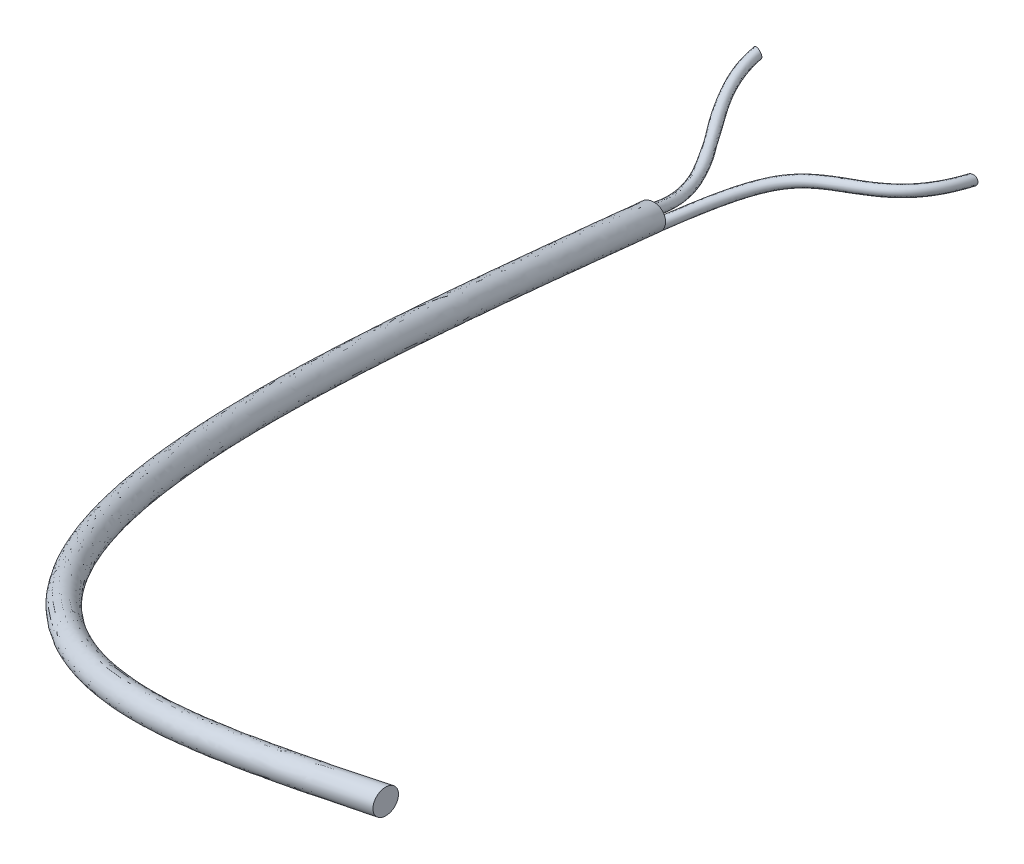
ISO-10303-21;
HEADER;
FILE_DESCRIPTION(('STEP AP214'),'2;1');
FILE_NAME('part.step','',(''),(''),'','','');
FILE_SCHEMA(('AUTOMOTIVE_DESIGN { 1 0 10303 214 1 1 1 1 }'));
ENDSEC;
DATA;
#1=APPLICATION_CONTEXT('core data for automotive mechanical design processes');
#2=APPLICATION_PROTOCOL_DEFINITION('international standard','automotive_design',2000,#1);
#3=PRODUCT_CONTEXT('',#1,'mechanical');
#4=PRODUCT('Part','Part','',(#3));
#5=PRODUCT_RELATED_PRODUCT_CATEGORY('part','',(#4));
#6=PRODUCT_DEFINITION_FORMATION('','',#4);
#7=PRODUCT_DEFINITION_CONTEXT('part definition',#1,'design');
#8=PRODUCT_DEFINITION('design','',#6,#7);
#9=PRODUCT_DEFINITION_SHAPE('','',#8);
#10=(LENGTH_UNIT() NAMED_UNIT(*) SI_UNIT(.MILLI.,.METRE.));
#11=(NAMED_UNIT(*) PLANE_ANGLE_UNIT() SI_UNIT($,.RADIAN.));
#12=(NAMED_UNIT(*) SI_UNIT($,.STERADIAN.) SOLID_ANGLE_UNIT());
#13=UNCERTAINTY_MEASURE_WITH_UNIT(LENGTH_MEASURE(1.E-05),#10,'distance_accuracy_value','');
#14=(GEOMETRIC_REPRESENTATION_CONTEXT(3) GLOBAL_UNCERTAINTY_ASSIGNED_CONTEXT((#13)) GLOBAL_UNIT_ASSIGNED_CONTEXT((#10,
#11,#12)) REPRESENTATION_CONTEXT('',''));
#15=CARTESIAN_POINT('',(0.,0.,0.));
#16=DIRECTION('',(0.,0.,1.));
#17=DIRECTION('',(1.,0.,0.));
#18=AXIS2_PLACEMENT_3D('',#15,#16,#17);
#19=CARTESIAN_POINT('',(-64.9711588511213,16.9950768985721,-22.9119439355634));
#20=DIRECTION('',(0.124674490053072,0.0569347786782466,0.990562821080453));
#21=DIRECTION('',(0.992172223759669,0.,-0.124877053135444));
#22=AXIS2_PLACEMENT_3D('',#19,#20,#21);
#23=PLANE('',#22);
#24=CARTESIAN_POINT('',(-66.8322160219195,16.3155358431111,-22.6386489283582));
#25=DIRECTION('',(0.124674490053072,0.0569347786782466,0.990562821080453));
#26=DIRECTION('',(0.992172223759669,0.,-0.124877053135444));
#27=AXIS2_PLACEMENT_3D('',#24,#25,#26);
#28=CIRCLE('',#27,1.99999999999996);
#29=CARTESIAN_POINT('',(-65.2995270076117,15.036233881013,-22.7580259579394));
#30=VERTEX_POINT('',#29);
#31=CARTESIAN_POINT('',(-68.81661141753,16.3298441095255,-22.3897108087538));
#32=VERTEX_POINT('',#31);
#33=EDGE_CURVE('E93',#30,#32,#28,.T.);
#34=ORIENTED_EDGE('',*,*,#33,.F.);
#35=CARTESIAN_POINT('',(-65.9126026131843,15.5479546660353,-22.7102751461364));
#36=DIRECTION('',(-0.124674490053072,-0.0569347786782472,-0.990562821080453));
#37=DIRECTION('',(-0.99217222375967,0.,0.124877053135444));
#38=AXIS2_PLACEMENT_3D('',#35,#36,#37);
#39=CIRCLE('',#38,0.8);
#40=EDGE_CURVE('E104',#30,#30,#39,.T.);
#41=ORIENTED_EDGE('',*,*,#40,.F.);
#42=EDGE_CURVE('E12',#32,#30,#28,.T.);
#43=ORIENTED_EDGE('',*,*,#42,.F.);
#44=CARTESIAN_POINT('',(-68.0239498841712,16.3241287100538,-22.4891484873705));
#45=DIRECTION('',(-0.124674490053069,-0.0569347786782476,-0.990562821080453));
#46=DIRECTION('',(-0.99217222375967,0.,0.124877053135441));
#47=AXIS2_PLACEMENT_3D('',#44,#45,#46);
#48=CIRCLE('',#47,0.798894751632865);
#49=EDGE_CURVE('E106',#32,#32,#48,.T.);
#50=ORIENTED_EDGE('',*,*,#49,.F.);
#51=EDGE_LOOP('',(#34,#41,#43,#50));
#52=FACE_BOUND('',#51,.T.);
#53=ADVANCED_FACE('F85',(#52),#23,.F.);
#54=CARTESIAN_POINT('',(44.3111763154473,68.079244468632,128.664307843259));
#55=DIRECTION('',(0.999847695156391,-0.00872620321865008,0.0151142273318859));
#56=DIRECTION('',(0.0151148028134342,0.,-0.99988576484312));
#57=AXIS2_PLACEMENT_3D('',#54,#55,#56);
#58=PLANE('',#57);
#59=CARTESIAN_POINT('',(44.2809467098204,68.079244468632,130.664079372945));
#60=DIRECTION('',(-0.999847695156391,0.00872620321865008,-0.0151142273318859));
#61=DIRECTION('',(-0.0151148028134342,0.,0.99988576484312));
#62=AXIS2_PLACEMENT_3D('',#59,#60,#61);
#63=CIRCLE('',#62,1.99999999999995);
#64=CARTESIAN_POINT('',(44.2507171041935,68.079244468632,132.663850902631));
#65=VERTEX_POINT('',#64);
#66=EDGE_CURVE('E88',#65,#65,#63,.T.);
#67=ORIENTED_EDGE('',*,*,#66,.F.);
#68=EDGE_LOOP('',(#67));
#69=FACE_BOUND('',#68,.T.);
#70=ADVANCED_FACE('F133',(#69),#58,.T.);
#71=CARTESIAN_POINT('',(44.2507171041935,68.079244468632,132.663850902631));
#72=CARTESIAN_POINT('',(38.0970515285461,67.1501813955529,133.10925624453));
#73=CARTESIAN_POINT('',(25.7897203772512,65.2920552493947,134.000066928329));
#74=CARTESIAN_POINT('',(13.6482865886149,63.1858835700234,133.619526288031));
#75=CARTESIAN_POINT('',(2.74693517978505,60.9868562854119,131.857661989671));
#76=CARTESIAN_POINT('',(-7.37339117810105,58.6268531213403,128.753174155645));
#77=CARTESIAN_POINT('',(-19.9101777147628,54.8174483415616,120.822175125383));
#78=CARTESIAN_POINT('',(-30.613543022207,50.5901726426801,109.555029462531));
#79=CARTESIAN_POINT('',(-42.3717978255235,44.5997558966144,90.9680845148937));
#80=CARTESIAN_POINT('',(-53.1240938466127,36.5398366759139,62.0646105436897));
#81=CARTESIAN_POINT('',(-61.9268502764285,26.239899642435,21.3330531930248));
#82=CARTESIAN_POINT('',(-66.437798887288,19.1706297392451,-7.79921821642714));
#83=CARTESIAN_POINT('',(-68.6932731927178,15.6359947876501,-22.3653539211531));
#84=CARTESIAN_POINT('',(44.2856179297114,72.0790921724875,132.664378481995));
#85=CARTESIAN_POINT('',(38.1252194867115,71.1501430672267,133.11548425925));
#86=CARTESIAN_POINT('',(25.8044226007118,69.2922448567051,134.017695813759));
#87=CARTESIAN_POINT('',(13.5548760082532,67.1849072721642,133.714874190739));
#88=CARTESIAN_POINT('',(2.49844431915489,64.9761077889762,132.027140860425));
#89=CARTESIAN_POINT('',(-7.82025273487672,62.5984541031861,128.993726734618));
#90=CARTESIAN_POINT('',(-20.6298065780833,58.7466988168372,121.07708059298));
#91=CARTESIAN_POINT('',(-31.5607512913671,54.4724076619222,109.768044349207));
#92=CARTESIAN_POINT('',(-43.5306075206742,48.4283756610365,91.096493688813));
#93=CARTESIAN_POINT('',(-54.4185262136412,40.325192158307,62.0977494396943));
#94=CARTESIAN_POINT('',(-63.2929348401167,29.9993833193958,21.3019581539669));
#95=CARTESIAN_POINT('',(-67.8114112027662,22.9272135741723,-7.83789982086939));
#96=CARTESIAN_POINT('',(-70.0706493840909,19.3911287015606,-22.4078288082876));
#97=CARTESIAN_POINT('',(44.3460771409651,72.0790921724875,128.664835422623));
#98=CARTESIAN_POINT('',(38.2173253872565,71.1553610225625,129.115679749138));
#99=CARTESIAN_POINT('',(25.9598218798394,69.3078987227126,130.01736840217));
#100=CARTESIAN_POINT('',(14.1852436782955,67.2872990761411,129.749471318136));
#101=CARTESIAN_POINT('',(3.72036914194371,65.2108968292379,128.217606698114));
#102=CARTESIAN_POINT('',(-5.89870923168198,63.0076716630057,125.450829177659));
#103=CARTESIAN_POINT('',(-17.9466049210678,59.4135701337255,118.136922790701));
#104=CARTESIAN_POINT('',(-28.3715050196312,55.3657534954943,107.483310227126));
#105=CARTESIAN_POINT('',(-39.9805523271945,49.542047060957,89.5504559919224));
#106=CARTESIAN_POINT('',(-50.7358395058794,41.588844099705,61.1413947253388));
#107=CARTESIAN_POINT('',(-59.5735782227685,31.3452419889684,20.6965088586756));
#108=CARTESIAN_POINT('',(-64.0902161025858,24.2818878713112,-8.40410959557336));
#109=CARTESIAN_POINT('',(-66.3485350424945,20.7502108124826,-22.9544188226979));
#110=CARTESIAN_POINT('',(44.3111763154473,68.079244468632,128.664307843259));
#111=CARTESIAN_POINT('',(38.1891574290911,67.1553993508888,129.109451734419));
#112=CARTESIAN_POINT('',(25.9451196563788,65.3077091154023,129.999739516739));
#113=CARTESIAN_POINT('',(14.2786542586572,63.2882753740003,129.654123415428));
#114=CARTESIAN_POINT('',(3.96886000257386,61.2216453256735,128.04812782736));
#115=CARTESIAN_POINT('',(-5.45184767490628,59.0360706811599,125.210276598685));
#116=CARTESIAN_POINT('',(-17.2269760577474,55.4843196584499,117.882017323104));
#117=CARTESIAN_POINT('',(-27.424296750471,51.4835184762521,107.27029534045));
#118=CARTESIAN_POINT('',(-38.8217426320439,45.713427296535,89.4220468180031));
#119=CARTESIAN_POINT('',(-49.4414071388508,37.8034886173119,61.1082558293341));
#120=CARTESIAN_POINT('',(-58.2074936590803,27.5857583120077,20.7276038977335));
#121=CARTESIAN_POINT('',(-62.7166037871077,20.525304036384,-8.36542799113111));
#122=CARTESIAN_POINT('',(-64.9711588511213,16.9950768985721,-22.9119439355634));
#123=CARTESIAN_POINT('',(44.2762754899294,64.0793967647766,128.663780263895));
#124=CARTESIAN_POINT('',(38.1609894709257,63.1554376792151,129.103223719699));
#125=CARTESIAN_POINT('',(25.9304174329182,61.3075195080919,129.982110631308));
#126=CARTESIAN_POINT('',(14.372064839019,59.2892516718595,129.558775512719));
#127=CARTESIAN_POINT('',(4.21735086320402,57.2323938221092,127.878648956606));
#128=CARTESIAN_POINT('',(-5.00498611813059,55.064469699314,124.969724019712));
#129=CARTESIAN_POINT('',(-16.5073471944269,51.5550691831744,117.627111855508));
#130=CARTESIAN_POINT('',(-26.4770884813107,47.6012834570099,107.057280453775));
#131=CARTESIAN_POINT('',(-37.6629329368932,41.884807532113,89.2936376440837));
#132=CARTESIAN_POINT('',(-48.1469747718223,34.0181331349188,61.0751169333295));
#133=CARTESIAN_POINT('',(-56.8414090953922,23.8262746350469,20.7586989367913));
#134=CARTESIAN_POINT('',(-61.3429914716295,16.7687202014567,-8.32674638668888));
#135=CARTESIAN_POINT('',(-63.5937826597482,13.2399429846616,-22.869469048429));
#136=CARTESIAN_POINT('',(44.2158162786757,64.0793967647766,132.663323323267));
#137=CARTESIAN_POINT('',(38.0688835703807,63.1502197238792,133.103028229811));
#138=CARTESIAN_POINT('',(25.7750181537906,61.2918656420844,133.982438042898));
#139=CARTESIAN_POINT('',(13.7416971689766,59.1868598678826,133.524178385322));
#140=CARTESIAN_POINT('',(2.99542604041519,56.9976047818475,131.688183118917));
#141=CARTESIAN_POINT('',(-6.92652962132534,54.6552521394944,128.512621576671));
#142=CARTESIAN_POINT('',(-19.1905488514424,50.8881978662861,120.567269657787));
#143=CARTESIAN_POINT('',(-29.6663347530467,46.7079376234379,109.342014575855));
#144=CARTESIAN_POINT('',(-41.2129881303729,40.7711361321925,90.8396753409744));
#145=CARTESIAN_POINT('',(-51.8296614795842,32.7544811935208,62.0314716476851));
#146=CARTESIAN_POINT('',(-60.5607657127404,22.4804159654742,21.3641482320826));
#147=CARTESIAN_POINT('',(-65.0641865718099,15.4140459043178,-7.76053661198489));
#148=CARTESIAN_POINT('',(-67.3158970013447,11.8808608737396,-22.3228790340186));
#149=CARTESIAN_POINT('',(44.2507171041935,68.079244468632,132.663850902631));
#150=CARTESIAN_POINT('',(38.0970515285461,67.1501813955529,133.10925624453));
#151=CARTESIAN_POINT('',(25.7897203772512,65.2920552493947,134.000066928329));
#152=CARTESIAN_POINT('',(13.6482865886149,63.1858835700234,133.619526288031));
#153=CARTESIAN_POINT('',(2.74693517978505,60.9868562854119,131.857661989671));
#154=CARTESIAN_POINT('',(-7.37339117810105,58.6268531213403,128.753174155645));
#155=CARTESIAN_POINT('',(-19.9101777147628,54.8174483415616,120.822175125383));
#156=CARTESIAN_POINT('',(-30.613543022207,50.5901726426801,109.555029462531));
#157=CARTESIAN_POINT('',(-42.3717978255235,44.5997558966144,90.9680845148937));
#158=CARTESIAN_POINT('',(-53.1240938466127,36.5398366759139,62.0646105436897));
#159=CARTESIAN_POINT('',(-61.9268502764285,26.239899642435,21.3330531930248));
#160=CARTESIAN_POINT('',(-66.437798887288,19.1706297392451,-7.79921821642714));
#161=CARTESIAN_POINT('',(-68.6932731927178,15.6359947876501,-22.3653539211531));
#162=(BOUNDED_SURFACE() B_SPLINE_SURFACE(3,3,((#71,#72,#73,#74,#75,#76,#77,#78,#79,#80,#81,#82,
#83),(#84,#85,#86,#87,#88,#89,#90,#91,#92,#93,#94,#95,#96),(#97,#98,#99,#100,#101,#102,#103,
#104,#105,#106,#107,#108,#109),(#110,#111,#112,#113,#114,#115,#116,#117,#118,#119,#120,#121,
#122),(#123,#124,#125,#126,#127,#128,#129,#130,#131,#132,#133,#134,#135),(#136,#137,#138,#139,
#140,#141,#142,#143,#144,#145,#146,#147,#148),(#149,#150,#151,#152,#153,#154,#155,#156,#157,
#158,#159,#160,#161)),.UNSPECIFIED.,.T.,.F.,.F.) B_SPLINE_SURFACE_WITH_KNOTS((4,3,4),(4,1,1,1,1,
1,1,1,1,1,4),(0.,0.5,1.),(0.,0.0833333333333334,0.166666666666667,0.172957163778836,0.25,
0.333333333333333,0.416666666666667,0.5,0.666666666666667,0.833333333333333,1.),
.UNSPECIFIED.) GEOMETRIC_REPRESENTATION_ITEM() RATIONAL_B_SPLINE_SURFACE(((1.,1.,1.,1.,1.,1.,1.,
1.,1.,1.,1.,1.,1.),(0.333333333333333,0.333333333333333,0.333333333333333,0.333333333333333,
0.333333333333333,0.333333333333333,0.333333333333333,0.333333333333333,0.333333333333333,
0.333333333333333,0.333333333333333,0.333333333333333,0.333333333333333),(0.333333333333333,
0.333333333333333,0.333333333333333,0.333333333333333,0.333333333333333,0.333333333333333,
0.333333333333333,0.333333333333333,0.333333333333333,0.333333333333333,0.333333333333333,
0.333333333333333,0.333333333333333),(1.,1.,1.,1.,1.,1.,1.,1.,1.,1.,1.,1.,1.),
(0.333333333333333,0.333333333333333,0.333333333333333,0.333333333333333,0.333333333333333,
0.333333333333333,0.333333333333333,0.333333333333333,0.333333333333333,0.333333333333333,
0.333333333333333,0.333333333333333,0.333333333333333),(0.333333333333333,0.333333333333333,
0.333333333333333,0.333333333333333,0.333333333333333,0.333333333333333,0.333333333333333,
0.333333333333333,0.333333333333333,0.333333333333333,0.333333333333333,0.333333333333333,
0.333333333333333),(1.,1.,1.,1.,1.,1.,1.,1.,1.,1.,1.,1.,1.))) REPRESENTATION_ITEM('') SURFACE());
#163=ORIENTED_EDGE('',*,*,#66,.T.);
#164=EDGE_LOOP('',(#163));
#165=FACE_BOUND('',#164,.T.);
#166=ORIENTED_EDGE('',*,*,#42,.T.);
#167=ORIENTED_EDGE('',*,*,#33,.T.);
#168=EDGE_LOOP('',(#166,#167));
#169=FACE_BOUND('',#168,.T.);
#170=ADVANCED_FACE('F99',(#165,#169),#162,.T.);
#171=CARTESIAN_POINT('',(-79.2309428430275,17.2186626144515,-51.9650187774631));
#172=DIRECTION('',(-0.191460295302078,-0.135172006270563,0.972147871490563));
#173=DIRECTION('',(0.981152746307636,0.,0.193233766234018));
#174=AXIS2_PLACEMENT_3D('',#171,#172,#173);
#175=PLANE('',#174);
#176=CARTESIAN_POINT('',(-79.1670124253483,18.0055930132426,-51.8430094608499));
#177=DIRECTION('',(-0.191460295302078,-0.135172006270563,0.972147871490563));
#178=DIRECTION('',(0.981152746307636,0.,0.193233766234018));
#179=AXIS2_PLACEMENT_3D('',#176,#177,#178);
#180=CIRCLE('',#179,0.798894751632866);
#181=CARTESIAN_POINT('',(-78.383174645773,18.0055930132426,-51.6886360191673));
#182=VERTEX_POINT('',#181);
#183=EDGE_CURVE('E108',#182,#182,#180,.T.);
#184=ORIENTED_EDGE('',*,*,#183,.F.);
#185=EDGE_LOOP('',(#184));
#186=FACE_BOUND('',#185,.T.);
#187=ADVANCED_FACE('F130',(#186),#175,.F.);
#188=CARTESIAN_POINT('',(-68.8165910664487,16.3241287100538,-22.3893848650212));
#189=CARTESIAN_POINT('',(-68.9098239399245,15.8339209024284,-23.8151459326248));
#190=CARTESIAN_POINT('',(-69.2360061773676,15.0504740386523,-26.4351889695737));
#191=CARTESIAN_POINT('',(-70.0460661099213,14.3905208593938,-29.7647572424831));
#192=CARTESIAN_POINT('',(-71.1108566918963,14.1622539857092,-32.6163329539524));
#193=CARTESIAN_POINT('',(-72.3155018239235,14.3201984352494,-35.1318663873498));
#194=CARTESIAN_POINT('',(-73.7148582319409,14.7569998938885,-37.3685242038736));
#195=CARTESIAN_POINT('',(-74.7597601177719,15.9868201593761,-40.1719923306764));
#196=CARTESIAN_POINT('',(-76.9739944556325,16.7239077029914,-42.9982751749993));
#197=CARTESIAN_POINT('',(-78.2919885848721,18.0676505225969,-46.9450855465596));
#198=CARTESIAN_POINT('',(-78.9476152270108,18.6176598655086,-49.995231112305));
#199=CARTESIAN_POINT('',(-79.1030820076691,18.7925234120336,-51.7210001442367));
#200=CARTESIAN_POINT('',(-68.8279511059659,17.919326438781,-22.4796425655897));
#201=CARTESIAN_POINT('',(-68.8845564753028,17.430420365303,-23.8668370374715));
#202=CARTESIAN_POINT('',(-69.1374837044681,16.6495769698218,-26.4097468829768));
#203=CARTESIAN_POINT('',(-69.7952536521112,15.9634048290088,-29.6193717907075));
#204=CARTESIAN_POINT('',(-70.6786597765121,15.6960145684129,-32.3670685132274));
#205=CARTESIAN_POINT('',(-71.6494071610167,15.7183856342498,-34.8655787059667));
#206=CARTESIAN_POINT('',(-72.8061357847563,16.1928665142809,-37.0864332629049));
#207=CARTESIAN_POINT('',(-73.0309815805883,16.1283289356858,-40.6904409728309));
#208=CARTESIAN_POINT('',(-75.5641933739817,17.4974093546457,-43.0278512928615));
#209=CARTESIAN_POINT('',(-76.6395659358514,17.9258102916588,-47.0793951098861));
#210=CARTESIAN_POINT('',(-77.3548010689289,18.4563667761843,-49.8506352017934));
#211=CARTESIAN_POINT('',(-77.5400720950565,18.6215038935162,-51.4369514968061));
#212=CARTESIAN_POINT('',(-67.2426687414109,17.919326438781,-22.6791698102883));
#213=CARTESIAN_POINT('',(-67.3067025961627,17.3982051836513,-24.1142003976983));
#214=CARTESIAN_POINT('',(-67.5744867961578,16.5529314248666,-26.7527824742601));
#215=CARTESIAN_POINT('',(-68.2948583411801,15.765770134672,-30.1386885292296));
#216=CARTESIAN_POINT('',(-69.2568844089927,15.4043868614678,-33.071086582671));
#217=CARTESIAN_POINT('',(-70.3956126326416,15.2749891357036,-35.6994725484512));
#218=CARTESIAN_POINT('',(-71.5435598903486,15.5989121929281,-38.1016988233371));
#219=CARTESIAN_POINT('',(-73.0669139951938,14.4155057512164,-41.300064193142));
#220=CARTESIAN_POINT('',(-74.9242658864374,16.30511165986,-43.9030981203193));
#221=CARTESIAN_POINT('',(-76.7795864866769,16.3227122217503,-47.4913801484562));
#222=CARTESIAN_POINT('',(-77.4867151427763,16.8727602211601,-50.150642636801));
#223=CARTESIAN_POINT('',(-77.667932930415,17.047643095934,-51.6809701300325));
#224=CARTESIAN_POINT('',(-67.2313087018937,16.3241287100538,-22.5889121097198));
#225=CARTESIAN_POINT('',(-67.3319700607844,15.8017057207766,-24.0625092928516));
#226=CARTESIAN_POINT('',(-67.6730092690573,14.9538284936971,-26.778224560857));
#227=CARTESIAN_POINT('',(-68.5456707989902,14.1928861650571,-30.2840739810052));
#228=CARTESIAN_POINT('',(-69.689081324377,13.8706262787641,-33.320351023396));
#229=CARTESIAN_POINT('',(-71.0617072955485,13.8768019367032,-35.9657602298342));
#230=CARTESIAN_POINT('',(-72.4522823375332,14.1630455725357,-38.3837897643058));
#231=CARTESIAN_POINT('',(-74.7956925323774,14.2739969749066,-40.7816155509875));
#232=CARTESIAN_POINT('',(-76.3340669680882,15.5316100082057,-43.8735220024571));
#233=CARTESIAN_POINT('',(-78.4320091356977,16.4645524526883,-47.3570705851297));
#234=CARTESIAN_POINT('',(-79.0795293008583,17.0340533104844,-50.2952385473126));
#235=CARTESIAN_POINT('',(-79.2309428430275,17.2186626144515,-51.9650187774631));
#236=CARTESIAN_POINT('',(-67.2199486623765,14.7289309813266,-22.4986544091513));
#237=CARTESIAN_POINT('',(-67.357237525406,14.205206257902,-24.0108181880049));
#238=CARTESIAN_POINT('',(-67.7715317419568,13.3547255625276,-26.8036666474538));
#239=CARTESIAN_POINT('',(-68.7964832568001,12.6200021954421,-30.4294594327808));
#240=CARTESIAN_POINT('',(-70.1212782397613,12.3368656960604,-33.5696154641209));
#241=CARTESIAN_POINT('',(-71.7278019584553,12.4786147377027,-36.2320479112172));
#242=CARTESIAN_POINT('',(-73.3610047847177,12.7271789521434,-38.6658807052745));
#243=CARTESIAN_POINT('',(-76.524471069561,14.1324881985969,-40.2631669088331));
#244=CARTESIAN_POINT('',(-77.743868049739,14.7581083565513,-43.843945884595));
#245=CARTESIAN_POINT('',(-80.0844317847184,16.6063926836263,-47.2227610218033));
#246=CARTESIAN_POINT('',(-80.6723434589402,17.1953463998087,-50.4398344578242));
#247=CARTESIAN_POINT('',(-80.79395275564,17.3896821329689,-52.2490674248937));
#248=CARTESIAN_POINT('',(-68.8052310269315,14.7289309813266,-22.2991271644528));
#249=CARTESIAN_POINT('',(-68.9350914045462,14.2374214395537,-23.7634548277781));
#250=CARTESIAN_POINT('',(-69.3345286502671,13.4513711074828,-26.4606310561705));
#251=CARTESIAN_POINT('',(-70.2968785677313,12.8176368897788,-29.9101426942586));
#252=CARTESIAN_POINT('',(-71.5430536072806,12.6284934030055,-32.8655973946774));
#253=CARTESIAN_POINT('',(-72.9815964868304,12.922011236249,-35.3981540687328));
#254=CARTESIAN_POINT('',(-74.6235806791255,13.3211332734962,-37.6506151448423));
#255=CARTESIAN_POINT('',(-76.4885386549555,15.8453113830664,-39.6535436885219));
#256=CARTESIAN_POINT('',(-78.3837955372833,15.950406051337,-42.9686990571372));
#257=CARTESIAN_POINT('',(-79.9444112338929,18.2094907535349,-46.8107759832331));
#258=CARTESIAN_POINT('',(-80.5404293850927,18.778952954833,-50.1398270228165));
#259=CARTESIAN_POINT('',(-80.6660919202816,18.9635429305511,-52.0050487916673));
#260=CARTESIAN_POINT('',(-68.8165910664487,16.3241287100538,-22.3893848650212));
#261=CARTESIAN_POINT('',(-68.9098239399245,15.8339209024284,-23.8151459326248));
#262=CARTESIAN_POINT('',(-69.2360061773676,15.0504740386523,-26.4351889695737));
#263=CARTESIAN_POINT('',(-70.0460661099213,14.3905208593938,-29.7647572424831));
#264=CARTESIAN_POINT('',(-71.1108566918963,14.1622539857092,-32.6163329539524));
#265=CARTESIAN_POINT('',(-72.3155018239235,14.3201984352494,-35.1318663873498));
#266=CARTESIAN_POINT('',(-73.7148582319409,14.7569998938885,-37.3685242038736));
#267=CARTESIAN_POINT('',(-74.7597601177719,15.9868201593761,-40.1719923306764));
#268=CARTESIAN_POINT('',(-76.9739944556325,16.7239077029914,-42.9982751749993));
#269=CARTESIAN_POINT('',(-78.2919885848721,18.0676505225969,-46.9450855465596));
#270=CARTESIAN_POINT('',(-78.9476152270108,18.6176598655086,-49.995231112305));
#271=CARTESIAN_POINT('',(-79.1030820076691,18.7925234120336,-51.7210001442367));
#272=(BOUNDED_SURFACE() B_SPLINE_SURFACE(3,3,((#188,#189,#190,#191,#192,#193,#194,#195,#196,
#197,#198,#199),(#200,#201,#202,#203,#204,#205,#206,#207,#208,#209,#210,#211),(#212,#213,#214,
#215,#216,#217,#218,#219,#220,#221,#222,#223),(#224,#225,#226,#227,#228,#229,#230,#231,#232,
#233,#234,#235),(#236,#237,#238,#239,#240,#241,#242,#243,#244,#245,#246,#247),(#248,#249,#250,
#251,#252,#253,#254,#255,#256,#257,#258,#259),(#260,#261,#262,#263,#264,#265,#266,#267,#268,
#269,#270,#271)),.UNSPECIFIED.,.T.,.F.,.F.) B_SPLINE_SURFACE_WITH_KNOTS((4,3,4),(4,1,1,1,1,1,1,
1,1,4),(0.,0.5,1.),(0.,0.0933333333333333,0.186666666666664,0.28,0.373333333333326,
0.46666666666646,0.56,0.70666666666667,0.853333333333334,1.),
.UNSPECIFIED.) GEOMETRIC_REPRESENTATION_ITEM() RATIONAL_B_SPLINE_SURFACE(((1.,1.,1.,1.,1.,1.,1.,
1.,1.,1.,1.,1.),(0.333333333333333,0.333333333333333,0.333333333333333,0.333333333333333,
0.333333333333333,0.333333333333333,0.333333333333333,0.333333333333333,0.333333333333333,
0.333333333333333,0.333333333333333,0.333333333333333),(0.333333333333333,0.333333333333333,
0.333333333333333,0.333333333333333,0.333333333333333,0.333333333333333,0.333333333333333,
0.333333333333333,0.333333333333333,0.333333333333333,0.333333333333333,0.333333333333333),(1.,
1.,1.,1.,1.,1.,1.,1.,1.,1.,1.,1.),(0.333333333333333,0.333333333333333,0.333333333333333,
0.333333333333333,0.333333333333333,0.333333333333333,0.333333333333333,0.333333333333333,
0.333333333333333,0.333333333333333,0.333333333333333,0.333333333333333),(0.333333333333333,
0.333333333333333,0.333333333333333,0.333333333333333,0.333333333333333,0.333333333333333,
0.333333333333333,0.333333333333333,0.333333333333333,0.333333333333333,0.333333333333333,
0.333333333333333),(1.,1.,1.,1.,1.,1.,1.,1.,1.,1.,1.,1.))) REPRESENTATION_ITEM('') SURFACE());
#273=ORIENTED_EDGE('',*,*,#49,.T.);
#274=EDGE_LOOP('',(#273));
#275=FACE_BOUND('',#274,.T.);
#276=ORIENTED_EDGE('',*,*,#183,.T.);
#277=EDGE_LOOP('',(#276));
#278=FACE_BOUND('',#277,.T.);
#279=ADVANCED_FACE('F122',(#275,#278),#272,.T.);
#280=CARTESIAN_POINT('',(-44.58375100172,17.0122549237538,-51.9666104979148));
#281=DIRECTION('',(0.219859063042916,0.0181117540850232,0.975363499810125));
#282=DIRECTION('',(0.975523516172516,0.,-0.219895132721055));
#283=AXIS2_PLACEMENT_3D('',#280,#281,#282);
#284=PLANE('',#283);
#285=CARTESIAN_POINT('',(-45.1752701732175,17.5364951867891,-51.8430094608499));
#286=DIRECTION('',(0.219859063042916,0.0181117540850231,0.975363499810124));
#287=DIRECTION('',(0.975523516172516,0.,-0.219895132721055));
#288=AXIS2_PLACEMENT_3D('',#285,#286,#287);
#289=CIRCLE('',#288,0.800000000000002);
#290=CARTESIAN_POINT('',(-44.3948513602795,17.5364951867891,-52.0189255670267));
#291=VERTEX_POINT('',#290);
#292=EDGE_CURVE('E111',#291,#291,#289,.T.);
#293=ORIENTED_EDGE('',*,*,#292,.F.);
#294=EDGE_LOOP('',(#293));
#295=FACE_BOUND('',#294,.T.);
#296=ADVANCED_FACE('F120',(#295),#284,.F.);
#297=CARTESIAN_POINT('',(-66.7063403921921,15.5479546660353,-22.610373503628));
#298=CARTESIAN_POINT('',(-66.4290473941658,15.6246885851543,-23.9013756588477));
#299=CARTESIAN_POINT('',(-65.8744613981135,15.7781564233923,-26.4833799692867));
#300=CARTESIAN_POINT('',(-64.9407023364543,16.0247132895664,-30.2065645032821));
#301=CARTESIAN_POINT('',(-63.7902010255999,16.304486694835,-33.5956056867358));
#302=CARTESIAN_POINT('',(-62.5624383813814,16.5821284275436,-35.9861584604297));
#303=CARTESIAN_POINT('',(-61.3125072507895,16.8425772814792,-37.592043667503));
#304=CARTESIAN_POINT('',(-59.8860643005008,17.1524923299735,-38.9051072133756));
#305=CARTESIAN_POINT('',(-57.4402359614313,17.762851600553,-40.2324682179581));
#306=CARTESIAN_POINT('',(-53.9748223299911,18.1771016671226,-41.4030245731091));
#307=CARTESIAN_POINT('',(-51.1761718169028,18.7901732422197,-42.3939850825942));
#308=CARTESIAN_POINT('',(-49.4892541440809,18.8548735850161,-43.6157126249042));
#309=CARTESIAN_POINT('',(-48.632691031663,18.860187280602,-44.4183055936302));
#310=CARTESIAN_POINT('',(-47.8495149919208,18.8159932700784,-45.3951989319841));
#311=CARTESIAN_POINT('',(-47.1523723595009,18.7212564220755,-46.5779762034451));
#312=CARTESIAN_POINT('',(-46.5572240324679,18.5691767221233,-47.9989408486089));
#313=CARTESIAN_POINT('',(-46.0813282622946,18.3548156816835,-49.6857644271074));
#314=CARTESIAN_POINT('',(-45.8547032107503,18.1665737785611,-51.0072744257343));
#315=CARTESIAN_POINT('',(-45.7667893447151,18.0607354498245,-51.719408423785));
#316=CARTESIAN_POINT('',(-66.7177161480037,17.1453593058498,-22.7007560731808));
#317=CARTESIAN_POINT('',(-66.4400070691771,17.2221665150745,-23.9908087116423));
#318=CARTESIAN_POINT('',(-65.884588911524,17.3757809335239,-26.570913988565));
#319=CARTESIAN_POINT('',(-64.9439452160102,17.6230752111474,-30.2764298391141));
#320=CARTESIAN_POINT('',(-63.7835952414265,17.9048609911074,-33.6334339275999));
#321=CARTESIAN_POINT('',(-62.5468826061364,18.1806537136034,-35.9682570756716));
#322=CARTESIAN_POINT('',(-61.3023958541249,18.4439920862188,-37.5204072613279));
#323=CARTESIAN_POINT('',(-59.8667050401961,18.7464189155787,-38.7390950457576));
#324=CARTESIAN_POINT('',(-57.3166735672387,19.2892291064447,-39.746590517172));
#325=CARTESIAN_POINT('',(-53.9895364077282,19.806663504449,-41.2155455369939));
#326=CARTESIAN_POINT('',(-50.7010267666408,20.1688878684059,-41.6908415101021));
#327=CARTESIAN_POINT('',(-48.8077694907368,20.2127786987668,-43.1079470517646));
#328=CARTESIAN_POINT('',(-47.8383577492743,20.1959281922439,-44.0249794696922));
#329=CARTESIAN_POINT('',(-46.9647284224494,20.1285815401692,-45.1433043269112));
#330=CARTESIAN_POINT('',(-46.2023429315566,20.0073018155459,-46.4709171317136));
#331=CARTESIAN_POINT('',(-45.5670471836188,19.8280165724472,-48.0288247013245));
#332=CARTESIAN_POINT('',(-45.0696703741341,19.5870924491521,-49.8380173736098));
#333=CARTESIAN_POINT('',(-44.83870233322,19.3828273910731,-51.2259886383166));
#334=CARTESIAN_POINT('',(-44.7486169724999,19.2689774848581,-51.9713532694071));
#335=CARTESIAN_POINT('',(-65.1302405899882,17.1453593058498,-22.9005593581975));
#336=CARTESIAN_POINT('',(-64.8518527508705,17.2222115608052,-24.185173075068));
#337=CARTESIAN_POINT('',(-64.2950770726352,17.3759160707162,-26.7544005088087));
#338=CARTESIAN_POINT('',(-63.3441189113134,17.6229680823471,-30.3655725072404));
#339=CARTESIAN_POINT('',(-62.1828623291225,17.9027441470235,-33.5411775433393));
#340=CARTESIAN_POINT('',(-60.9692308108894,18.1651553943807,-35.6183682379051));
#341=CARTESIAN_POINT('',(-59.8464396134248,18.4079183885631,-36.8540333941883));
#342=CARTESIAN_POINT('',(-58.5685586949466,18.6391615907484,-37.7774181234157));
#343=CARTESIAN_POINT('',(-56.2576544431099,18.8515137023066,-38.619004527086));
#344=CARTESIAN_POINT('',(-52.9843929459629,19.6565631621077,-39.9230199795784));
#345=CARTESIAN_POINT('',(-49.5644252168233,19.3714664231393,-40.8529256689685));
#346=CARTESIAN_POINT('',(-47.574402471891,19.3792297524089,-42.5177561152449));
#347=CARTESIAN_POINT('',(-46.5658328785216,19.319233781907,-43.5967276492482));
#348=CARTESIAN_POINT('',(-45.674377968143,19.2148270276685,-44.8804894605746));
#349=CARTESIAN_POINT('',(-44.9175419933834,19.0551071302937,-46.3667598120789));
#350=CARTESIAN_POINT('',(-44.3065845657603,18.8400659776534,-48.0648285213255));
#351=CARTESIAN_POINT('',(-43.8451538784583,18.5664114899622,-49.9932326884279));
#352=CARTESIAN_POINT('',(-43.6418379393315,18.3436133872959,-51.4425284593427));
#353=CARTESIAN_POINT('',(-43.5655786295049,18.2204969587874,-52.2185553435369));
#354=CARTESIAN_POINT('',(-65.1188648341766,15.5479546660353,-22.8101767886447));
#355=CARTESIAN_POINT('',(-64.8408930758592,15.6247336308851,-24.0957400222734));
#356=CARTESIAN_POINT('',(-64.2849495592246,15.7782915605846,-26.6668664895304));
#357=CARTESIAN_POINT('',(-63.3408760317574,16.0246061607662,-30.2957071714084));
#358=CARTESIAN_POINT('',(-62.1894681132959,16.3023698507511,-33.5033493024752));
#359=CARTESIAN_POINT('',(-60.9847865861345,16.5666301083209,-35.6362696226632));
#360=CARTESIAN_POINT('',(-59.8565510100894,16.8065035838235,-36.9256698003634));
#361=CARTESIAN_POINT('',(-58.5879179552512,17.0452350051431,-37.9434302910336));
#362=CARTESIAN_POINT('',(-56.3812168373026,17.3251361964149,-39.1048822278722));
#363=CARTESIAN_POINT('',(-52.9696788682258,18.0270013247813,-40.1104990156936));
#364=CARTESIAN_POINT('',(-50.0395702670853,17.9927517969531,-41.5560692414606));
#365=CARTESIAN_POINT('',(-48.2558871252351,18.0213246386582,-43.0255216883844));
#366=CARTESIAN_POINT('',(-47.3601661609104,17.9834928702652,-43.9900537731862));
#367=CARTESIAN_POINT('',(-46.5591645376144,17.9022387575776,-45.1323840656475));
#368=CARTESIAN_POINT('',(-45.8675714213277,17.7690617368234,-46.4738188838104));
#369=CARTESIAN_POINT('',(-45.2967614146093,17.5812261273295,-48.0349446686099));
#370=CARTESIAN_POINT('',(-44.8568117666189,17.3341347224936,-49.8409797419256));
#371=CARTESIAN_POINT('',(-44.6578388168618,17.127359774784,-51.2238142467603));
#372=CARTESIAN_POINT('',(-44.58375100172,17.0122549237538,-51.9666104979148));
#373=CARTESIAN_POINT('',(-65.107489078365,13.9505500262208,-22.719794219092));
#374=CARTESIAN_POINT('',(-64.829933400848,14.0272557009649,-24.0063069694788));
#375=CARTESIAN_POINT('',(-64.2748220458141,14.180667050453,-26.5793324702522));
#376=CARTESIAN_POINT('',(-63.3376331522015,14.4262442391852,-30.2258418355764));
#377=CARTESIAN_POINT('',(-62.1960738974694,14.7019955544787,-33.4655210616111));
#378=CARTESIAN_POINT('',(-61.0003423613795,14.9681048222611,-35.6541710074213));
#379=CARTESIAN_POINT('',(-59.8666624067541,15.2050887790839,-36.9973062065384));
#380=CARTESIAN_POINT('',(-58.6072772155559,15.4513084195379,-38.1094424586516));
#381=CARTESIAN_POINT('',(-56.5047792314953,15.7987586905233,-39.5907599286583));
#382=CARTESIAN_POINT('',(-52.9549647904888,16.3974394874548,-40.2979780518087));
#383=CARTESIAN_POINT('',(-50.5147153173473,16.614037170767,-42.2592128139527));
#384=CARTESIAN_POINT('',(-48.9373717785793,16.6634195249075,-43.5332872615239));
#385=CARTESIAN_POINT('',(-48.1544994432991,16.6477519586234,-44.3833798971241));
#386=CARTESIAN_POINT('',(-47.4439511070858,16.5896504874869,-45.3842786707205));
#387=CARTESIAN_POINT('',(-46.817600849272,16.483016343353,-46.5808779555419));
#388=CARTESIAN_POINT('',(-46.2869382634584,16.3223862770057,-48.0050608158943));
#389=CARTESIAN_POINT('',(-45.8684696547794,16.1018579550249,-49.6887267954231));
#390=CARTESIAN_POINT('',(-45.6738396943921,15.911106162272,-51.005100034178));
#391=CARTESIAN_POINT('',(-45.6019233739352,15.8040128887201,-51.7146656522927));
#392=CARTESIAN_POINT('',(-66.6949646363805,13.9505500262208,-22.5199909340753));
#393=CARTESIAN_POINT('',(-66.4180877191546,14.0272106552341,-23.8119426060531));
#394=CARTESIAN_POINT('',(-65.8643338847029,14.1805319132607,-26.3958459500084));
#395=CARTESIAN_POINT('',(-64.9374594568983,14.4263513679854,-30.1366991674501));
#396=CARTESIAN_POINT('',(-63.7968068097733,14.7041123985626,-33.5577774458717));
#397=CARTESIAN_POINT('',(-62.5779941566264,14.9836031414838,-36.0040598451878));
#398=CARTESIAN_POINT('',(-61.3226186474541,15.2411624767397,-37.663680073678));
#399=CARTESIAN_POINT('',(-59.9054235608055,15.5585657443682,-39.0711193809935));
#400=CARTESIAN_POINT('',(-57.563798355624,16.2364740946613,-40.7183459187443));
#401=CARTESIAN_POINT('',(-53.9601082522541,16.5475398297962,-41.5905036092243));
#402=CARTESIAN_POINT('',(-51.6513168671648,17.4114586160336,-43.0971286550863));
#403=CARTESIAN_POINT('',(-50.1707387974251,17.4969684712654,-44.1234781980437));
#404=CARTESIAN_POINT('',(-49.4270243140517,17.5244463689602,-44.8116317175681));
#405=CARTESIAN_POINT('',(-48.7343015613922,17.5034049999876,-45.6470935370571));
#406=CARTESIAN_POINT('',(-48.1024017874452,17.4352110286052,-46.6850352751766));
#407=CARTESIAN_POINT('',(-47.5474008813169,17.3103368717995,-47.9690569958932));
#408=CARTESIAN_POINT('',(-47.0929861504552,17.1225389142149,-49.533511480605));
#409=CARTESIAN_POINT('',(-46.8707040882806,16.9503201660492,-50.7885602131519));
#410=CARTESIAN_POINT('',(-46.7849617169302,16.8524934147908,-51.4674635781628));
#411=CARTESIAN_POINT('',(-66.7063403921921,15.5479546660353,-22.610373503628));
#412=CARTESIAN_POINT('',(-66.4290473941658,15.6246885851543,-23.9013756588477));
#413=CARTESIAN_POINT('',(-65.8744613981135,15.7781564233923,-26.4833799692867));
#414=CARTESIAN_POINT('',(-64.9407023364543,16.0247132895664,-30.2065645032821));
#415=CARTESIAN_POINT('',(-63.7902010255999,16.304486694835,-33.5956056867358));
#416=CARTESIAN_POINT('',(-62.5624383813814,16.5821284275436,-35.9861584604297));
#417=CARTESIAN_POINT('',(-61.3125072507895,16.8425772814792,-37.592043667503));
#418=CARTESIAN_POINT('',(-59.8860643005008,17.1524923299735,-38.9051072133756));
#419=CARTESIAN_POINT('',(-57.4402359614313,17.762851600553,-40.2324682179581));
#420=CARTESIAN_POINT('',(-53.9748223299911,18.1771016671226,-41.4030245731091));
#421=CARTESIAN_POINT('',(-51.1761718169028,18.7901732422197,-42.3939850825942));
#422=CARTESIAN_POINT('',(-49.4892541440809,18.8548735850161,-43.6157126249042));
#423=CARTESIAN_POINT('',(-48.632691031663,18.860187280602,-44.4183055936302));
#424=CARTESIAN_POINT('',(-47.8495149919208,18.8159932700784,-45.3951989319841));
#425=CARTESIAN_POINT('',(-47.1523723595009,18.7212564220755,-46.5779762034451));
#426=CARTESIAN_POINT('',(-46.5572240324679,18.5691767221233,-47.9989408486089));
#427=CARTESIAN_POINT('',(-46.0813282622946,18.3548156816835,-49.6857644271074));
#428=CARTESIAN_POINT('',(-45.8547032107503,18.1665737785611,-51.0072744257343));
#429=CARTESIAN_POINT('',(-45.7667893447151,18.0607354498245,-51.719408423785));
#430=(BOUNDED_SURFACE() B_SPLINE_SURFACE(3,3,((#297,#298,#299,#300,#301,#302,#303,#304,#305,
#306,#307,#308,#309,#310,#311,#312,#313,#314,#315),(#316,#317,#318,#319,#320,#321,#322,#323,
#324,#325,#326,#327,#328,#329,#330,#331,#332,#333,#334),(#335,#336,#337,#338,#339,#340,#341,
#342,#343,#344,#345,#346,#347,#348,#349,#350,#351,#352,#353),(#354,#355,#356,#357,#358,#359,
#360,#361,#362,#363,#364,#365,#366,#367,#368,#369,#370,#371,#372),(#373,#374,#375,#376,#377,
#378,#379,#380,#381,#382,#383,#384,#385,#386,#387,#388,#389,#390,#391),(#392,#393,#394,#395,
#396,#397,#398,#399,#400,#401,#402,#403,#404,#405,#406,#407,#408,#409,#410),(#411,#412,#413,
#414,#415,#416,#417,#418,#419,#420,#421,#422,#423,#424,#425,#426,#427,#428,#429)),.UNSPECIFIED.,
.T.,.F.,.F.) B_SPLINE_SURFACE_WITH_KNOTS((4,3,4),(4,1,1,1,1,1,1,1,1,1,1,1,1,1,1,1,4),(0.,0.5,
1.),(0.,0.0833333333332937,0.166666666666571,0.25,0.333333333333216,0.373646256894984,
0.416666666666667,0.500000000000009,0.625,0.750000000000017,0.785714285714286,0.821428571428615,
0.857142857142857,0.892857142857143,0.928571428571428,0.964285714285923,1.),
.UNSPECIFIED.) GEOMETRIC_REPRESENTATION_ITEM() RATIONAL_B_SPLINE_SURFACE(((1.,1.,1.,1.,1.,1.,1.,
1.,1.,1.,1.,1.,1.,1.,1.,1.,1.,1.,1.),(0.333333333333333,0.333333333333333,0.333333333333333,
0.333333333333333,0.333333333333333,0.333333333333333,0.333333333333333,0.333333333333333,
0.333333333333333,0.333333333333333,0.333333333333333,0.333333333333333,0.333333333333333,
0.333333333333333,0.333333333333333,0.333333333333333,0.333333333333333,0.333333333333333,
0.333333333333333),(0.333333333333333,0.333333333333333,0.333333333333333,0.333333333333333,
0.333333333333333,0.333333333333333,0.333333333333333,0.333333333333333,0.333333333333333,
0.333333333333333,0.333333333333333,0.333333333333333,0.333333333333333,0.333333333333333,
0.333333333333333,0.333333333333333,0.333333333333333,0.333333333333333,0.333333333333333),(1.,
1.,1.,1.,1.,1.,1.,1.,1.,1.,1.,1.,1.,1.,1.,1.,1.,1.,1.),(0.333333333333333,0.333333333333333,
0.333333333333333,0.333333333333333,0.333333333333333,0.333333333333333,0.333333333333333,
0.333333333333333,0.333333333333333,0.333333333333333,0.333333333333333,0.333333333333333,
0.333333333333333,0.333333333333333,0.333333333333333,0.333333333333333,0.333333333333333,
0.333333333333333,0.333333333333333),(0.333333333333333,0.333333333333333,0.333333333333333,
0.333333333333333,0.333333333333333,0.333333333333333,0.333333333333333,0.333333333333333,
0.333333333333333,0.333333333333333,0.333333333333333,0.333333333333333,0.333333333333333,
0.333333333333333,0.333333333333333,0.333333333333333,0.333333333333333,0.333333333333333,
0.333333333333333),(1.,1.,1.,1.,1.,1.,1.,1.,1.,1.,1.,1.,1.,1.,1.,1.,1.,1.,1.))) REPRESENTATION_ITEM('') SURFACE());
#431=ORIENTED_EDGE('',*,*,#40,.T.);
#432=EDGE_LOOP('',(#431));
#433=FACE_BOUND('',#432,.T.);
#434=ORIENTED_EDGE('',*,*,#292,.T.);
#435=EDGE_LOOP('',(#434));
#436=FACE_BOUND('',#435,.T.);
#437=ADVANCED_FACE('F118',(#433,#436),#430,.T.);
#438=CLOSED_SHELL('',(#53,#70,#170,#187,#279,#296,#437));
#439=MANIFOLD_SOLID_BREP('B2',#438);
#440=ADVANCED_BREP_SHAPE_REPRESENTATION('',(#18,#439),#14);
#441=SHAPE_DEFINITION_REPRESENTATION(#9,#440);
ENDSEC;
END-ISO-10303-21;
